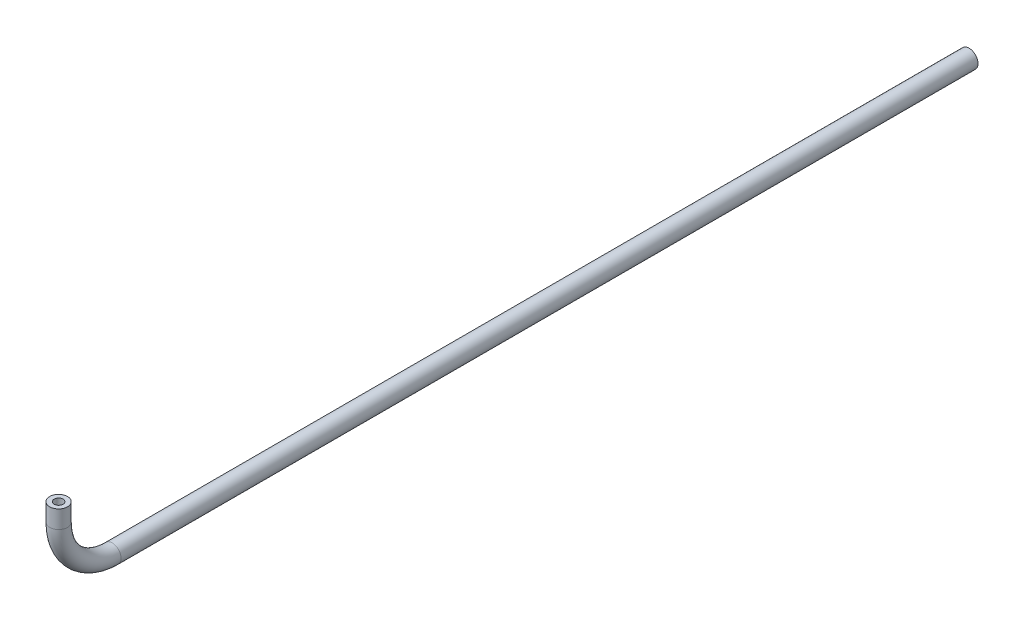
from build123d import *

# Parameters (mm, degrees)
SKETCH1_R   = 0.79375
SKETCH1_R_2 = 0.396875


with BuildPart() as part:
    # Sweep1: sweep along a path in Sketch2
    with BuildLine(Plane(origin=(0, 0, 0), x_dir=(0, 0, -1), z_dir=(1, 0, 0))) as sweep1_path:
        Line((0, 0), (0, -1.5875))
        ThreePointArc((0, -1.5875), (1.394903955, -4.955096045), (4.7625, -6.35))
        Line((4.7625, -6.35), (80.9625, -6.35))
    # Sketch1 → Sweep1 (sweep)
    with BuildSketch(Plane(origin=(0, 0, 0), x_dir=(1, 0, 0), z_dir=(0, 1, 0))):
        Circle(SKETCH1_R)
        Circle(SKETCH1_R_2, mode=Mode.SUBTRACT)
    sweep(path=sweep1_path.line)


solid = part.part
